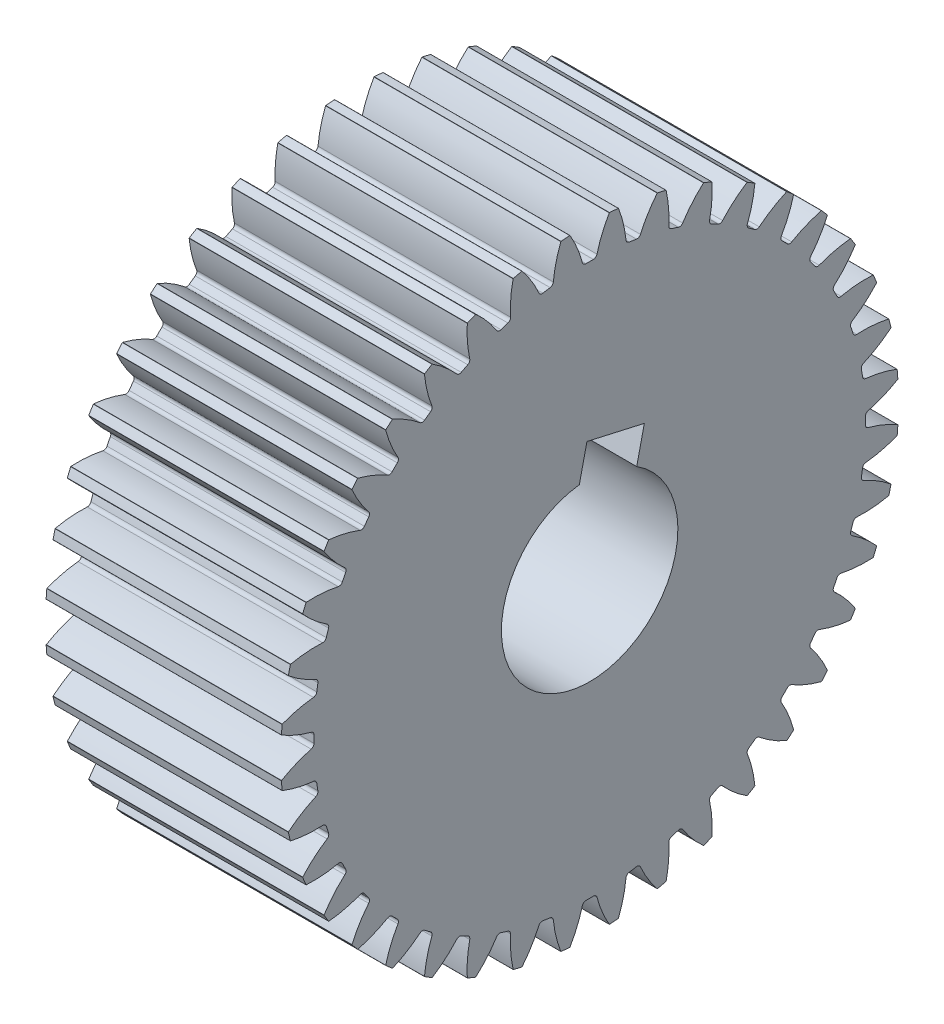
from build123d import *

# Parameters (mm, degrees)
BASPROSKE_W                = 16
BASPROSKE_H                = 21
TOOTHCUT_DEPTH             = 34.734255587
BREAKS_R                   = 0.02
ROOTFILLETS_R              = 0.251
TEETHCUTS_COUNT            = 40
TEETHCUTS_ANGLE            = 351
BREAKS_OF_TEETHCUTS_R      = 0.02
ROOTFILLETS_OF_TEETHCUTS_R = 0.251
BORSKE_R                   = 0.4
BORE_DEPTH                 = 50.0000508
CUT_EXTRUDE_1_DEPTH        = 34.680036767


with BuildPart() as part:
    # BasProSke → Base-Revolve (revolve)
    with BuildSketch(Plane(origin=(0, 0, 0), x_dir=(1, 0, 0), z_dir=(0, 1, 0)), mode=Mode.PRIVATE) as base_revolve_sk:
        with Locations((8, 10.5)):
            Rectangle(BASPROSKE_W, BASPROSKE_H)
    revolve(base_revolve_sk.sketch.rotate(Axis((-10, 0, 0), (1, 0, 0)), 180), axis=Axis((-10, 0, 0), (1, 0, 0)))

    # TooCutSke → ToothCut (cut, through all)
    with BuildSketch(Plane(origin=(0, 0, 0), x_dir=(0, 0, -1), z_dir=(1, 0, 0))):
        with BuildLine():
            ThreePointArc((0.448673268, 18.74363074), (0, 18.749), (-0.448673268, 18.74363074))
            ThreePointArc((-0.448673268, 18.74363074), (-0.816786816, 19.89705013), (-1.354745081, 20.981708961))
            ThreePointArc((-1.354745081, 20.981708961), (0, 21.0254), (1.354745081, 20.981708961))
            ThreePointArc((1.354745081, 20.981708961), (0.816786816, 19.89705013), (0.448673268, 18.74363074))
        make_face()
    toothcut = extrude(amount=TOOTHCUT_DEPTH, mode=Mode.SUBTRACT)

    # Breaks
    breaks_edges = [part.edges().sort_by_distance(p)[0] for p in [
        (8, 20.957189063, -1.34023378),
        (8, 20.957189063, 1.34023378),
    ]]
    fillet(breaks_edges, radius=BREAKS_R)

    # RootFillets
    rootfillets_edges = [part.edges().sort_by_distance(p)[0] for p in [
        (8, 18.74363074, -0.448673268),
        (8, 18.74363074, 0.448673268),
    ]]
    fillet(rootfillets_edges, radius=ROOTFILLETS_R)

    # TeethCuts: ToothCut ×40 about axis
    teethcuts_axis = Axis((-10, 0, 0), (1, 0, 0))
    for i in range(1, TEETHCUTS_COUNT):
        add(toothcut.rotate(teethcuts_axis, i * TEETHCUTS_ANGLE / (TEETHCUTS_COUNT - 1)), mode=Mode.SUBTRACT)

    # Breaks of TeethCuts
    breaks_of_teethcuts_edges = [part.edges().sort_by_distance(p)[0] for p in [
        (8, 20.908830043, 1.954693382),
        (8, 20.489512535, 4.602159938),
        (8, 20.345626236, 5.201489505),
        (8, 19.517316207, 7.750765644),
        (8, 19.281445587, 8.320207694),
        (8, 18.06453878, 10.708521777),
        (8, 17.742491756, 11.234054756),
        (8, 16.166952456, 13.402598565),
        (8, 15.766658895, 13.871282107),
        (8, 13.871282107, 15.766658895),
        (8, 13.402598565, 16.166952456),
        (8, 11.234054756, 17.742491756),
        (8, 10.708521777, 18.06453878),
        (8, 8.320207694, 19.281445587),
        (8, 7.750765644, 19.517316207),
        (8, 5.201489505, 20.345626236),
        (8, 4.602159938, 20.489512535),
        (8, 1.954693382, 20.908830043),
        (8, 1.34023378, 20.957189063),
        (8, -1.34023378, 20.957189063),
        (8, -1.954693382, 20.908830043),
        (8, -4.602159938, 20.489512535),
        (8, -5.201489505, 20.345626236),
        (8, -7.750765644, 19.517316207),
        (8, -8.320207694, 19.281445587),
        (8, -10.708521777, 18.06453878),
        (8, -11.234054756, 17.742491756),
        (8, -13.402598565, 16.166952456),
        (8, -13.871282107, 15.766658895),
        (8, -15.766658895, 13.871282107),
        (8, -16.166952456, 13.402598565),
        (8, -17.742491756, 11.234054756),
        (8, -18.06453878, 10.708521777),
        (8, -19.281445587, 8.320207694),
        (8, -19.517316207, 7.750765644),
        (8, -20.345626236, 5.201489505),
        (8, -20.489512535, 4.602159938),
        (8, -20.908830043, 1.954693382),
        (8, -20.957189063, 1.34023378),
        (8, -20.957189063, -1.34023378),
        (8, -20.908830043, -1.954693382),
        (8, -20.489512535, -4.602159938),
        (8, -20.345626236, -5.201489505),
        (8, -19.517316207, -7.750765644),
        (8, -19.281445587, -8.320207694),
        (8, -18.06453878, -10.708521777),
        (8, -17.742491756, -11.234054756),
        (8, -16.166952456, -13.402598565),
        (8, -15.766658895, -13.871282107),
        (8, -13.871282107, -15.766658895),
        (8, -13.402598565, -16.166952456),
        (8, -11.234054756, -17.742491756),
        (8, -10.708521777, -18.06453878),
        (8, -8.320207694, -19.281445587),
        (8, -7.750765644, -19.517316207),
        (8, -5.201489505, -20.345626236),
        (8, -4.602159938, -20.489512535),
        (8, -1.954693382, -20.908830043),
        (8, -1.34023378, -20.957189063),
        (8, 1.34023378, -20.957189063),
        (8, 1.954693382, -20.908830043),
        (8, 4.602159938, -20.489512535),
        (8, 5.201489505, -20.345626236),
        (8, 7.750765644, -19.517316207),
        (8, 8.320207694, -19.281445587),
        (8, 10.708521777, -18.06453878),
        (8, 11.234054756, -17.742491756),
        (8, 13.402598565, -16.166952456),
        (8, 13.871282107, -15.766658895),
        (8, 15.766658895, -13.871282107),
        (8, 16.166952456, -13.402598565),
        (8, 17.742491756, -11.234054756),
        (8, 18.06453878, -10.708521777),
        (8, 19.281445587, -8.320207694),
        (8, 19.517316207, -7.750765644),
        (8, 20.345626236, -5.201489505),
        (8, 20.489512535, -4.602159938),
        (8, 20.908830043, -1.954693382),
    ]]
    fillet(breaks_of_teethcuts_edges, radius=BREAKS_OF_TEETHCUTS_R)

    # RootFillets of TeethCuts
    rootfillets_of_teethcuts_edges = [part.edges().sort_by_distance(p)[0] for p in [
        (8, 18.583053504, 2.489000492),
        (8, 18.442677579, 3.375299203),
        (8, 17.964899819, 5.3653868),
        (8, 17.687604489, 6.21881407),
        (8, 16.904390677, 8.109659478),
        (8, 16.497003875, 8.909201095),
        (8, 15.427639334, 10.654245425),
        (8, 14.900192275, 11.380214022),
        (8, 13.57100831, 12.93648849),
        (8, 12.93648849, 13.57100831),
        (8, 11.380214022, 14.900192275),
        (8, 10.654245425, 15.427639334),
        (8, 8.909201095, 16.497003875),
        (8, 8.109659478, 16.904390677),
        (8, 6.21881407, 17.687604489),
        (8, 5.3653868, 17.964899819),
        (8, 3.375299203, 18.442677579),
        (8, 2.489000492, 18.583053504),
        (8, 0.448673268, 18.74363074),
        (8, -0.448673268, 18.74363074),
        (8, -2.489000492, 18.583053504),
        (8, -3.375299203, 18.442677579),
        (8, -5.3653868, 17.964899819),
        (8, -6.21881407, 17.687604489),
        (8, -8.109659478, 16.904390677),
        (8, -8.909201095, 16.497003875),
        (8, -10.654245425, 15.427639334),
        (8, -11.380214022, 14.900192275),
        (8, -12.93648849, 13.57100831),
        (8, -13.57100831, 12.93648849),
        (8, -14.900192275, 11.380214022),
        (8, -15.427639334, 10.654245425),
        (8, -16.497003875, 8.909201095),
        (8, -16.904390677, 8.109659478),
        (8, -17.687604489, 6.21881407),
        (8, -17.964899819, 5.3653868),
        (8, -18.442677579, 3.375299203),
        (8, -18.583053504, 2.489000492),
        (8, -18.74363074, 0.448673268),
        (8, -18.74363074, -0.448673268),
        (8, -18.583053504, -2.489000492),
        (8, -18.442677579, -3.375299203),
        (8, -17.964899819, -5.3653868),
        (8, -17.687604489, -6.21881407),
        (8, -16.904390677, -8.109659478),
        (8, -16.497003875, -8.909201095),
        (8, -15.427639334, -10.654245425),
        (8, -14.900192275, -11.380214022),
        (8, -13.57100831, -12.93648849),
        (8, -12.93648849, -13.57100831),
        (8, -11.380214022, -14.900192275),
        (8, -10.654245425, -15.427639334),
        (8, -8.909201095, -16.497003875),
        (8, -8.109659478, -16.904390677),
        (8, -6.21881407, -17.687604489),
        (8, -5.3653868, -17.964899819),
        (8, -3.375299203, -18.442677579),
        (8, -2.489000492, -18.583053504),
        (8, -0.448673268, -18.74363074),
        (8, 0.448673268, -18.74363074),
        (8, 2.489000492, -18.583053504),
        (8, 3.375299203, -18.442677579),
        (8, 5.3653868, -17.964899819),
        (8, 6.21881407, -17.687604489),
        (8, 8.109659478, -16.904390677),
        (8, 8.909201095, -16.497003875),
        (8, 10.654245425, -15.427639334),
        (8, 11.380214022, -14.900192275),
        (8, 12.93648849, -13.57100831),
        (8, 13.57100831, -12.93648849),
        (8, 14.900192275, -11.380214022),
        (8, 15.427639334, -10.654245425),
        (8, 16.497003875, -8.909201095),
        (8, 16.904390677, -8.109659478),
        (8, 17.687604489, -6.21881407),
        (8, 17.964899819, -5.3653868),
        (8, 18.442677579, -3.375299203),
        (8, 18.583053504, -2.489000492),
    ]]
    fillet(rootfillets_of_teethcuts_edges, radius=ROOTFILLETS_OF_TEETHCUTS_R)

    # BorSke → Bore (cut, symmetric)
    with BuildSketch(Plane(origin=(0, 0, 0), x_dir=(0, 0, -1), z_dir=(1, 0, 0))):
        with Locations(Location((0, 0, 0), (0, 0, 180))):
            Circle(BORSKE_R)
    extrude(amount=BORE_DEPTH, both=True, mode=Mode.SUBTRACT)

    # Sketch 1 → Cut-Extrude 1 (cut, through all)
    with BuildSketch(Plane.ZY):
        with BuildLine():
            Line((-3.71719511, 7.360873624), (-3.199779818, 5.075569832))
            ThreePointArc((-3.199779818, 5.075569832), (1.324924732, -5.851886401), (0.701477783, 5.958852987))
            Line((0.701477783, 5.958852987), (0.18406249, 8.244156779))
            Line((0.18406249, 8.244156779), (-3.71719511, 7.360873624))
        make_face()
    extrude(amount=-CUT_EXTRUDE_1_DEPTH, mode=Mode.SUBTRACT)


solid = part.part
